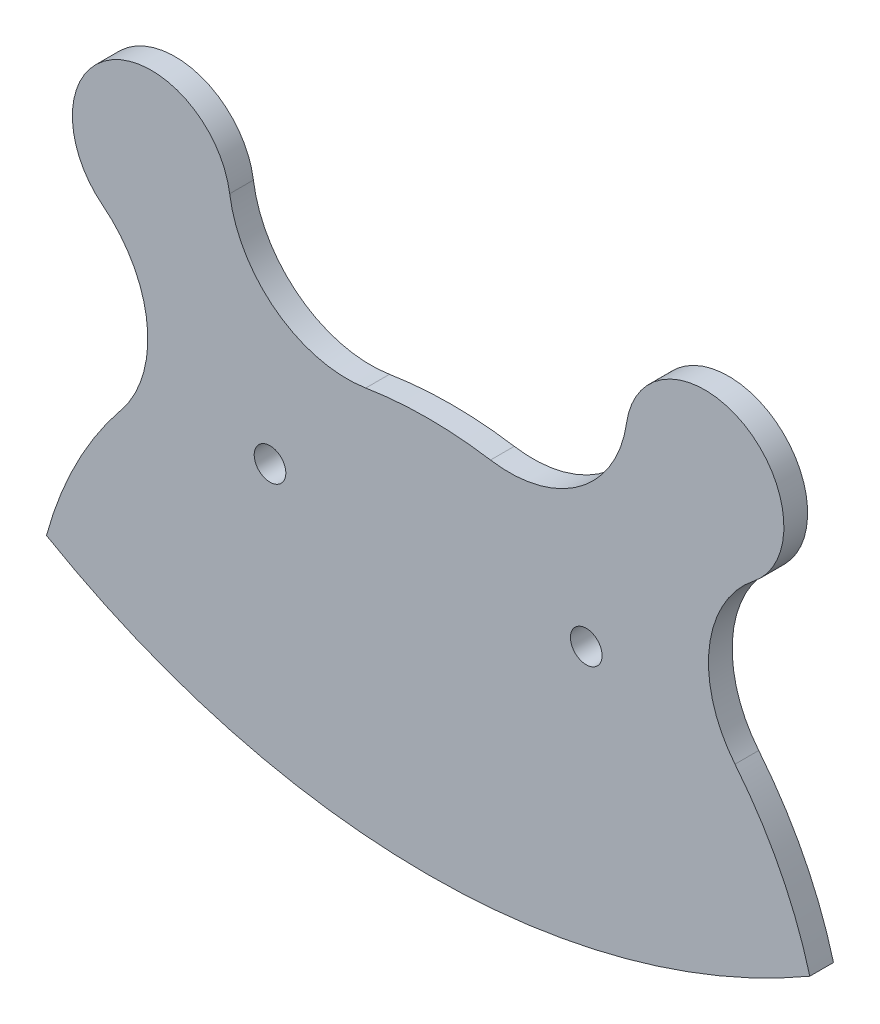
ISO-10303-21;
HEADER;
FILE_DESCRIPTION(('STEP AP214'),'2;1');
FILE_NAME('part.step','',(''),(''),'','','');
FILE_SCHEMA(('AUTOMOTIVE_DESIGN { 1 0 10303 214 1 1 1 1 }'));
ENDSEC;
DATA;
#1=APPLICATION_CONTEXT('core data for automotive mechanical design processes');
#2=APPLICATION_PROTOCOL_DEFINITION('international standard','automotive_design',2000,#1);
#3=PRODUCT_CONTEXT('',#1,'mechanical');
#4=PRODUCT('Part','Part','',(#3));
#5=PRODUCT_RELATED_PRODUCT_CATEGORY('part','',(#4));
#6=PRODUCT_DEFINITION_FORMATION('','',#4);
#7=PRODUCT_DEFINITION_CONTEXT('part definition',#1,'design');
#8=PRODUCT_DEFINITION('design','',#6,#7);
#9=PRODUCT_DEFINITION_SHAPE('','',#8);
#10=(LENGTH_UNIT() NAMED_UNIT(*) SI_UNIT(.MILLI.,.METRE.));
#11=(NAMED_UNIT(*) PLANE_ANGLE_UNIT() SI_UNIT($,.RADIAN.));
#12=(NAMED_UNIT(*) SI_UNIT($,.STERADIAN.) SOLID_ANGLE_UNIT());
#13=UNCERTAINTY_MEASURE_WITH_UNIT(LENGTH_MEASURE(1.E-05),#10,'distance_accuracy_value','');
#14=(GEOMETRIC_REPRESENTATION_CONTEXT(3) GLOBAL_UNCERTAINTY_ASSIGNED_CONTEXT((#13)) GLOBAL_UNIT_ASSIGNED_CONTEXT((#10,
#11,#12)) REPRESENTATION_CONTEXT('',''));
#15=CARTESIAN_POINT('',(0.,0.,0.));
#16=DIRECTION('',(0.,0.,1.));
#17=DIRECTION('',(1.,0.,0.));
#18=AXIS2_PLACEMENT_3D('',#15,#16,#17);
#19=CARTESIAN_POINT('',(-42.7294623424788,50.7980614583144,3.));
#20=DIRECTION('',(0.,0.,1.));
#21=DIRECTION('',(1.,0.,0.));
#22=AXIS2_PLACEMENT_3D('',#19,#20,#21);
#23=PLANE('',#22);
#24=CARTESIAN_POINT('',(-20.,35.,3.));
#25=DIRECTION('',(0.,0.,1.));
#26=DIRECTION('',(1.,0.,0.));
#27=AXIS2_PLACEMENT_3D('',#24,#25,#26);
#28=CIRCLE('',#27,2.);
#29=CARTESIAN_POINT('',(-18.,35.,3.));
#30=VERTEX_POINT('',#29);
#31=EDGE_CURVE('E143',#30,#30,#28,.T.);
#32=ORIENTED_EDGE('',*,*,#31,.F.);
#33=EDGE_LOOP('',(#32));
#34=FACE_BOUND('',#33,.T.);
#35=CARTESIAN_POINT('',(-50.4589246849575,40.9743446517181,3.));
#36=DIRECTION('',(0.,0.,-1.));
#37=DIRECTION('',(1.,0.,0.));
#38=AXIS2_PLACEMENT_3D('',#35,#36,#37);
#39=CIRCLE('',#38,15.);
#40=CARTESIAN_POINT('',(-41.183569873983,52.7628048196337,3.));
#41=VERTEX_POINT('',#40);
#42=CARTESIAN_POINT('',(-38.8145574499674,31.5187266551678,3.));
#43=VERTEX_POINT('',#42);
#44=EDGE_CURVE('E158',#41,#43,#39,.T.);
#45=ORIENTED_EDGE('',*,*,#44,.T.);
#46=CARTESIAN_POINT('',(0.,0.,3.));
#47=DIRECTION('',(0.,0.,1.));
#48=DIRECTION('',(1.,0.,0.));
#49=AXIS2_PLACEMENT_3D('',#46,#47,#48);
#50=CIRCLE('',#49,50.);
#51=CARTESIAN_POINT('',(-48.2748164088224,13.0208333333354,3.));
#52=VERTEX_POINT('',#51);
#53=EDGE_CURVE('E96',#43,#52,#50,.T.);
#54=ORIENTED_EDGE('',*,*,#53,.T.);
#55=CARTESIAN_POINT('',(0.,95.9999999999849,3.));
#56=DIRECTION('',(0.,0.,1.));
#57=DIRECTION('',(1.,0.,0.));
#58=AXIS2_PLACEMENT_3D('',#55,#56,#57);
#59=CIRCLE('',#58,95.9999999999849);
#60=CARTESIAN_POINT('',(48.2748164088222,13.0208333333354,3.));
#61=VERTEX_POINT('',#60);
#62=EDGE_CURVE('E179',#52,#61,#59,.T.);
#63=ORIENTED_EDGE('',*,*,#62,.T.);
#64=CARTESIAN_POINT('',(0.,0.,3.));
#65=DIRECTION('',(0.,0.,1.));
#66=DIRECTION('',(-1.,0.,0.));
#67=AXIS2_PLACEMENT_3D('',#64,#65,#66);
#68=CIRCLE('',#67,49.9999999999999);
#69=CARTESIAN_POINT('',(38.8145574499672,31.5187266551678,3.));
#70=VERTEX_POINT('',#69);
#71=EDGE_CURVE('E198',#61,#70,#68,.T.);
#72=ORIENTED_EDGE('',*,*,#71,.T.);
#73=CARTESIAN_POINT('',(50.4589246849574,40.9743446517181,3.));
#74=DIRECTION('',(0.,0.,-1.));
#75=DIRECTION('',(-1.,0.,0.));
#76=AXIS2_PLACEMENT_3D('',#73,#74,#75);
#77=CIRCLE('',#76,15.);
#78=CARTESIAN_POINT('',(41.1835698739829,52.7628048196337,3.));
#79=VERTEX_POINT('',#78);
#80=EDGE_CURVE('E195',#70,#79,#77,.T.);
#81=ORIENTED_EDGE('',*,*,#80,.T.);
#82=CARTESIAN_POINT('',(34.9999999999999,60.6217782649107,3.));
#83=DIRECTION('',(0.,0.,1.));
#84=DIRECTION('',(-1.,0.,0.));
#85=AXIS2_PLACEMENT_3D('',#82,#83,#84);
#86=CIRCLE('',#85,10.);
#87=CARTESIAN_POINT('',(25.1021444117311,62.0474201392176,3.));
#88=VERTEX_POINT('',#87);
#89=EDGE_CURVE('E197',#79,#88,#86,.T.);
#90=ORIENTED_EDGE('',*,*,#89,.T.);
#91=CARTESIAN_POINT('',(10.255361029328,64.185882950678,3.));
#92=DIRECTION('',(0.,0.,-1.));
#93=DIRECTION('',(-1.,0.,0.));
#94=AXIS2_PLACEMENT_3D('',#91,#92,#93);
#95=CIRCLE('',#94,15.);
#96=CARTESIAN_POINT('',(7.8887392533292,49.3737561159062,3.));
#97=VERTEX_POINT('',#96);
#98=EDGE_CURVE('E121',#88,#97,#95,.T.);
#99=ORIENTED_EDGE('',*,*,#98,.T.);
#100=CARTESIAN_POINT('',(0.,0.,3.));
#101=DIRECTION('',(0.,0.,1.));
#102=DIRECTION('',(1.,0.,0.));
#103=AXIS2_PLACEMENT_3D('',#100,#101,#102);
#104=CIRCLE('',#103,50.);
#105=CARTESIAN_POINT('',(-7.88873925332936,49.3737561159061,3.));
#106=VERTEX_POINT('',#105);
#107=EDGE_CURVE('E115',#97,#106,#104,.T.);
#108=ORIENTED_EDGE('',*,*,#107,.T.);
#109=CARTESIAN_POINT('',(-10.2553610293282,64.185882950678,3.));
#110=DIRECTION('',(0.,0.,-1.));
#111=DIRECTION('',(1.,0.,0.));
#112=AXIS2_PLACEMENT_3D('',#109,#110,#111);
#113=CIRCLE('',#112,15.);
#114=CARTESIAN_POINT('',(-25.1021444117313,62.0474201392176,3.));
#115=VERTEX_POINT('',#114);
#116=EDGE_CURVE('E119',#106,#115,#113,.T.);
#117=ORIENTED_EDGE('',*,*,#116,.T.);
#118=CARTESIAN_POINT('',(-35.,60.6217782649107,3.));
#119=DIRECTION('',(0.,0.,1.));
#120=DIRECTION('',(1.,0.,0.));
#121=AXIS2_PLACEMENT_3D('',#118,#119,#120);
#122=CIRCLE('',#121,10.);
#123=EDGE_CURVE('E47',#115,#41,#122,.T.);
#124=ORIENTED_EDGE('',*,*,#123,.T.);
#125=EDGE_LOOP('',(#45,#54,#63,#72,#81,#90,#99,#108,#117,#124));
#126=FACE_BOUND('',#125,.T.);
#127=CARTESIAN_POINT('',(20.,35.,3.));
#128=DIRECTION('',(0.,0.,1.));
#129=DIRECTION('',(1.,0.,0.));
#130=AXIS2_PLACEMENT_3D('',#127,#128,#129);
#131=CIRCLE('',#130,2.00000000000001);
#132=CARTESIAN_POINT('',(22.,35.,3.));
#133=VERTEX_POINT('',#132);
#134=EDGE_CURVE('E209',#133,#133,#131,.T.);
#135=ORIENTED_EDGE('',*,*,#134,.F.);
#136=EDGE_LOOP('',(#135));
#137=FACE_BOUND('',#136,.T.);
#138=ADVANCED_FACE('F30',(#34,#126,#137),#23,.T.);
#139=CARTESIAN_POINT('',(-42.7294623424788,50.7980614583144,0.));
#140=DIRECTION('',(0.,0.,1.));
#141=DIRECTION('',(1.,0.,0.));
#142=AXIS2_PLACEMENT_3D('',#139,#140,#141);
#143=PLANE('',#142);
#144=CARTESIAN_POINT('',(-20.,35.,0.));
#145=DIRECTION('',(0.,0.,1.));
#146=DIRECTION('',(1.,0.,0.));
#147=AXIS2_PLACEMENT_3D('',#144,#145,#146);
#148=CIRCLE('',#147,2.);
#149=CARTESIAN_POINT('',(-18.,35.,0.));
#150=VERTEX_POINT('',#149);
#151=EDGE_CURVE('E206',#150,#150,#148,.T.);
#152=ORIENTED_EDGE('',*,*,#151,.T.);
#153=EDGE_LOOP('',(#152));
#154=FACE_BOUND('',#153,.T.);
#155=CARTESIAN_POINT('',(-50.4589246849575,40.9743446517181,0.));
#156=DIRECTION('',(0.,0.,-1.));
#157=DIRECTION('',(1.,0.,0.));
#158=AXIS2_PLACEMENT_3D('',#155,#156,#157);
#159=CIRCLE('',#158,15.);
#160=CARTESIAN_POINT('',(-41.183569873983,52.7628048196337,0.));
#161=VERTEX_POINT('',#160);
#162=CARTESIAN_POINT('',(-38.8145574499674,31.5187266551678,0.));
#163=VERTEX_POINT('',#162);
#164=EDGE_CURVE('E139',#161,#163,#159,.T.);
#165=ORIENTED_EDGE('',*,*,#164,.F.);
#166=CARTESIAN_POINT('',(-35.,60.6217782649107,0.));
#167=DIRECTION('',(0.,0.,1.));
#168=DIRECTION('',(1.,0.,0.));
#169=AXIS2_PLACEMENT_3D('',#166,#167,#168);
#170=CIRCLE('',#169,10.);
#171=CARTESIAN_POINT('',(-25.1021444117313,62.0474201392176,0.));
#172=VERTEX_POINT('',#171);
#173=EDGE_CURVE('E88',#172,#161,#170,.T.);
#174=ORIENTED_EDGE('',*,*,#173,.F.);
#175=CARTESIAN_POINT('',(-10.2553610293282,64.185882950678,0.));
#176=DIRECTION('',(0.,0.,-1.));
#177=DIRECTION('',(1.,0.,0.));
#178=AXIS2_PLACEMENT_3D('',#175,#176,#177);
#179=CIRCLE('',#178,15.);
#180=CARTESIAN_POINT('',(-7.88873925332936,49.3737561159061,0.));
#181=VERTEX_POINT('',#180);
#182=EDGE_CURVE('E82',#181,#172,#179,.T.);
#183=ORIENTED_EDGE('',*,*,#182,.F.);
#184=CARTESIAN_POINT('',(0.,0.,0.));
#185=DIRECTION('',(0.,0.,1.));
#186=DIRECTION('',(1.,0.,0.));
#187=AXIS2_PLACEMENT_3D('',#184,#185,#186);
#188=CIRCLE('',#187,50.);
#189=CARTESIAN_POINT('',(7.8887392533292,49.3737561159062,0.));
#190=VERTEX_POINT('',#189);
#191=EDGE_CURVE('E129',#190,#181,#188,.T.);
#192=ORIENTED_EDGE('',*,*,#191,.F.);
#193=CARTESIAN_POINT('',(10.255361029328,64.185882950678,0.));
#194=DIRECTION('',(0.,0.,-1.));
#195=DIRECTION('',(-1.,0.,0.));
#196=AXIS2_PLACEMENT_3D('',#193,#194,#195);
#197=CIRCLE('',#196,15.);
#198=CARTESIAN_POINT('',(25.1021444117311,62.0474201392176,0.));
#199=VERTEX_POINT('',#198);
#200=EDGE_CURVE('E153',#199,#190,#197,.T.);
#201=ORIENTED_EDGE('',*,*,#200,.F.);
#202=CARTESIAN_POINT('',(34.9999999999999,60.6217782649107,0.));
#203=DIRECTION('',(0.,0.,1.));
#204=DIRECTION('',(-1.,0.,0.));
#205=AXIS2_PLACEMENT_3D('',#202,#203,#204);
#206=CIRCLE('',#205,10.);
#207=CARTESIAN_POINT('',(41.1835698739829,52.7628048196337,0.));
#208=VERTEX_POINT('',#207);
#209=EDGE_CURVE('E151',#208,#199,#206,.T.);
#210=ORIENTED_EDGE('',*,*,#209,.F.);
#211=CARTESIAN_POINT('',(50.4589246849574,40.9743446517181,0.));
#212=DIRECTION('',(0.,0.,-1.));
#213=DIRECTION('',(-1.,0.,0.));
#214=AXIS2_PLACEMENT_3D('',#211,#212,#213);
#215=CIRCLE('',#214,15.);
#216=CARTESIAN_POINT('',(38.8145574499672,31.5187266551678,0.));
#217=VERTEX_POINT('',#216);
#218=EDGE_CURVE('E149',#217,#208,#215,.T.);
#219=ORIENTED_EDGE('',*,*,#218,.F.);
#220=CARTESIAN_POINT('',(0.,0.,0.));
#221=DIRECTION('',(0.,0.,1.));
#222=DIRECTION('',(-1.,0.,0.));
#223=AXIS2_PLACEMENT_3D('',#220,#221,#222);
#224=CIRCLE('',#223,49.9999999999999);
#225=CARTESIAN_POINT('',(48.2748164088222,13.0208333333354,0.));
#226=VERTEX_POINT('',#225);
#227=EDGE_CURVE('E147',#226,#217,#224,.T.);
#228=ORIENTED_EDGE('',*,*,#227,.F.);
#229=CARTESIAN_POINT('',(0.,95.9999999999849,0.));
#230=DIRECTION('',(0.,0.,1.));
#231=DIRECTION('',(1.,0.,0.));
#232=AXIS2_PLACEMENT_3D('',#229,#230,#231);
#233=CIRCLE('',#232,95.9999999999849);
#234=CARTESIAN_POINT('',(-48.2748164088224,13.0208333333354,0.));
#235=VERTEX_POINT('',#234);
#236=EDGE_CURVE('E145',#235,#226,#233,.T.);
#237=ORIENTED_EDGE('',*,*,#236,.F.);
#238=CARTESIAN_POINT('',(0.,0.,0.));
#239=DIRECTION('',(0.,0.,1.));
#240=DIRECTION('',(1.,0.,0.));
#241=AXIS2_PLACEMENT_3D('',#238,#239,#240);
#242=CIRCLE('',#241,50.);
#243=EDGE_CURVE('E142',#163,#235,#242,.T.);
#244=ORIENTED_EDGE('',*,*,#243,.F.);
#245=EDGE_LOOP('',(#165,#174,#183,#192,#201,#210,#219,#228,#237,#244));
#246=FACE_BOUND('',#245,.T.);
#247=CARTESIAN_POINT('',(20.,35.,0.));
#248=DIRECTION('',(0.,0.,1.));
#249=DIRECTION('',(1.,0.,0.));
#250=AXIS2_PLACEMENT_3D('',#247,#248,#249);
#251=CIRCLE('',#250,2.00000000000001);
#252=CARTESIAN_POINT('',(22.,35.,0.));
#253=VERTEX_POINT('',#252);
#254=EDGE_CURVE('E212',#253,#253,#251,.T.);
#255=ORIENTED_EDGE('',*,*,#254,.T.);
#256=EDGE_LOOP('',(#255));
#257=FACE_BOUND('',#256,.T.);
#258=ADVANCED_FACE('F183',(#154,#246,#257),#143,.F.);
#259=CARTESIAN_POINT('',(-50.4589246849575,40.9743446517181,3.));
#260=DIRECTION('',(0.,0.,-1.));
#261=DIRECTION('',(-1.,0.,0.));
#262=AXIS2_PLACEMENT_3D('',#259,#260,#261);
#263=CYLINDRICAL_SURFACE('',#262,15.);
#264=ORIENTED_EDGE('',*,*,#164,.T.);
#265=DIRECTION('',(0.,0.,-1.));
#266=VECTOR('',#265,1.);
#267=CARTESIAN_POINT('',(-38.8145574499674,31.5187266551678,3.));
#268=LINE('',#267,#266);
#269=EDGE_CURVE('E11',#43,#163,#268,.T.);
#270=ORIENTED_EDGE('',*,*,#269,.F.);
#271=ORIENTED_EDGE('',*,*,#44,.F.);
#272=DIRECTION('',(0.,0.,-1.));
#273=VECTOR('',#272,1.);
#274=CARTESIAN_POINT('',(-41.183569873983,52.7628048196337,3.));
#275=LINE('',#274,#273);
#276=EDGE_CURVE('E135',#41,#161,#275,.T.);
#277=ORIENTED_EDGE('',*,*,#276,.T.);
#278=EDGE_LOOP('',(#264,#270,#271,#277));
#279=FACE_BOUND('',#278,.T.);
#280=ADVANCED_FACE('F32',(#279),#263,.F.);
#281=CARTESIAN_POINT('',(0.,0.,3.));
#282=DIRECTION('',(0.,0.,-1.));
#283=DIRECTION('',(-1.,0.,0.));
#284=AXIS2_PLACEMENT_3D('',#281,#282,#283);
#285=CYLINDRICAL_SURFACE('',#284,50.);
#286=ORIENTED_EDGE('',*,*,#243,.T.);
#287=DIRECTION('',(0.,0.,-1.));
#288=VECTOR('',#287,1.);
#289=CARTESIAN_POINT('',(-48.2748164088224,13.0208333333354,3.));
#290=LINE('',#289,#288);
#291=EDGE_CURVE('E39',#52,#235,#290,.T.);
#292=ORIENTED_EDGE('',*,*,#291,.F.);
#293=ORIENTED_EDGE('',*,*,#53,.F.);
#294=ORIENTED_EDGE('',*,*,#269,.T.);
#295=EDGE_LOOP('',(#286,#292,#293,#294));
#296=FACE_BOUND('',#295,.T.);
#297=ADVANCED_FACE('F253',(#296),#285,.T.);
#298=CARTESIAN_POINT('',(0.,95.9999999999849,3.));
#299=DIRECTION('',(0.,0.,-1.));
#300=DIRECTION('',(-1.,0.,0.));
#301=AXIS2_PLACEMENT_3D('',#298,#299,#300);
#302=CYLINDRICAL_SURFACE('',#301,95.9999999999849);
#303=ORIENTED_EDGE('',*,*,#236,.T.);
#304=DIRECTION('',(0.,0.,-1.));
#305=VECTOR('',#304,1.);
#306=CARTESIAN_POINT('',(48.2748164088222,13.0208333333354,3.));
#307=LINE('',#306,#305);
#308=EDGE_CURVE('E171',#61,#226,#307,.T.);
#309=ORIENTED_EDGE('',*,*,#308,.F.);
#310=ORIENTED_EDGE('',*,*,#62,.F.);
#311=ORIENTED_EDGE('',*,*,#291,.T.);
#312=EDGE_LOOP('',(#303,#309,#310,#311));
#313=FACE_BOUND('',#312,.T.);
#314=ADVANCED_FACE('F177',(#313),#302,.T.);
#315=CARTESIAN_POINT('',(0.,0.,3.));
#316=DIRECTION('',(0.,0.,-1.));
#317=DIRECTION('',(-1.,0.,0.));
#318=AXIS2_PLACEMENT_3D('',#315,#316,#317);
#319=CYLINDRICAL_SURFACE('',#318,49.9999999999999);
#320=ORIENTED_EDGE('',*,*,#227,.T.);
#321=DIRECTION('',(0.,0.,-1.));
#322=VECTOR('',#321,1.);
#323=CARTESIAN_POINT('',(38.8145574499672,31.5187266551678,3.));
#324=LINE('',#323,#322);
#325=EDGE_CURVE('E168',#70,#217,#324,.T.);
#326=ORIENTED_EDGE('',*,*,#325,.F.);
#327=ORIENTED_EDGE('',*,*,#71,.F.);
#328=ORIENTED_EDGE('',*,*,#308,.T.);
#329=EDGE_LOOP('',(#320,#326,#327,#328));
#330=FACE_BOUND('',#329,.T.);
#331=ADVANCED_FACE('F189',(#330),#319,.T.);
#332=CARTESIAN_POINT('',(50.4589246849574,40.9743446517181,3.));
#333=DIRECTION('',(0.,0.,-1.));
#334=DIRECTION('',(-1.,0.,0.));
#335=AXIS2_PLACEMENT_3D('',#332,#333,#334);
#336=CYLINDRICAL_SURFACE('',#335,15.);
#337=ORIENTED_EDGE('',*,*,#218,.T.);
#338=DIRECTION('',(0.,0.,-1.));
#339=VECTOR('',#338,1.);
#340=CARTESIAN_POINT('',(41.1835698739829,52.7628048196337,3.));
#341=LINE('',#340,#339);
#342=EDGE_CURVE('E165',#79,#208,#341,.T.);
#343=ORIENTED_EDGE('',*,*,#342,.F.);
#344=ORIENTED_EDGE('',*,*,#80,.F.);
#345=ORIENTED_EDGE('',*,*,#325,.T.);
#346=EDGE_LOOP('',(#337,#343,#344,#345));
#347=FACE_BOUND('',#346,.T.);
#348=ADVANCED_FACE('F193',(#347),#336,.F.);
#349=CARTESIAN_POINT('',(34.9999999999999,60.6217782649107,3.));
#350=DIRECTION('',(0.,0.,-1.));
#351=DIRECTION('',(-1.,0.,0.));
#352=AXIS2_PLACEMENT_3D('',#349,#350,#351);
#353=CYLINDRICAL_SURFACE('',#352,10.);
#354=ORIENTED_EDGE('',*,*,#209,.T.);
#355=DIRECTION('',(0.,0.,-1.));
#356=VECTOR('',#355,1.);
#357=CARTESIAN_POINT('',(25.1021444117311,62.0474201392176,3.));
#358=LINE('',#357,#356);
#359=EDGE_CURVE('E162',#88,#199,#358,.T.);
#360=ORIENTED_EDGE('',*,*,#359,.F.);
#361=ORIENTED_EDGE('',*,*,#89,.F.);
#362=ORIENTED_EDGE('',*,*,#342,.T.);
#363=EDGE_LOOP('',(#354,#360,#361,#362));
#364=FACE_BOUND('',#363,.T.);
#365=ADVANCED_FACE('F243',(#364),#353,.T.);
#366=CARTESIAN_POINT('',(10.255361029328,64.185882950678,3.));
#367=DIRECTION('',(0.,0.,-1.));
#368=DIRECTION('',(-1.,0.,0.));
#369=AXIS2_PLACEMENT_3D('',#366,#367,#368);
#370=CYLINDRICAL_SURFACE('',#369,15.);
#371=ORIENTED_EDGE('',*,*,#200,.T.);
#372=DIRECTION('',(0.,0.,-1.));
#373=VECTOR('',#372,1.);
#374=CARTESIAN_POINT('',(7.8887392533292,49.3737561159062,3.));
#375=LINE('',#374,#373);
#376=EDGE_CURVE('E130',#97,#190,#375,.T.);
#377=ORIENTED_EDGE('',*,*,#376,.F.);
#378=ORIENTED_EDGE('',*,*,#98,.F.);
#379=ORIENTED_EDGE('',*,*,#359,.T.);
#380=EDGE_LOOP('',(#371,#377,#378,#379));
#381=FACE_BOUND('',#380,.T.);
#382=ADVANCED_FACE('F240',(#381),#370,.F.);
#383=CARTESIAN_POINT('',(0.,0.,3.));
#384=DIRECTION('',(0.,0.,-1.));
#385=DIRECTION('',(-1.,0.,0.));
#386=AXIS2_PLACEMENT_3D('',#383,#384,#385);
#387=CYLINDRICAL_SURFACE('',#386,50.);
#388=ORIENTED_EDGE('',*,*,#191,.T.);
#389=DIRECTION('',(0.,0.,-1.));
#390=VECTOR('',#389,1.);
#391=CARTESIAN_POINT('',(-7.88873925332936,49.3737561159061,3.));
#392=LINE('',#391,#390);
#393=EDGE_CURVE('E126',#106,#181,#392,.T.);
#394=ORIENTED_EDGE('',*,*,#393,.F.);
#395=ORIENTED_EDGE('',*,*,#107,.F.);
#396=ORIENTED_EDGE('',*,*,#376,.T.);
#397=EDGE_LOOP('',(#388,#394,#395,#396));
#398=FACE_BOUND('',#397,.T.);
#399=ADVANCED_FACE('F127',(#398),#387,.T.);
#400=CARTESIAN_POINT('',(-10.2553610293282,64.185882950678,3.));
#401=DIRECTION('',(0.,0.,-1.));
#402=DIRECTION('',(-1.,0.,0.));
#403=AXIS2_PLACEMENT_3D('',#400,#401,#402);
#404=CYLINDRICAL_SURFACE('',#403,15.);
#405=ORIENTED_EDGE('',*,*,#182,.T.);
#406=DIRECTION('',(0.,0.,-1.));
#407=VECTOR('',#406,1.);
#408=CARTESIAN_POINT('',(-25.1021444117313,62.0474201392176,3.));
#409=LINE('',#408,#407);
#410=EDGE_CURVE('E131',#115,#172,#409,.T.);
#411=ORIENTED_EDGE('',*,*,#410,.F.);
#412=ORIENTED_EDGE('',*,*,#116,.F.);
#413=ORIENTED_EDGE('',*,*,#393,.T.);
#414=EDGE_LOOP('',(#405,#411,#412,#413));
#415=FACE_BOUND('',#414,.T.);
#416=ADVANCED_FACE('F133',(#415),#404,.F.);
#417=CARTESIAN_POINT('',(-35.,60.6217782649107,3.));
#418=DIRECTION('',(0.,0.,-1.));
#419=DIRECTION('',(-1.,0.,0.));
#420=AXIS2_PLACEMENT_3D('',#417,#418,#419);
#421=CYLINDRICAL_SURFACE('',#420,10.);
#422=ORIENTED_EDGE('',*,*,#173,.T.);
#423=ORIENTED_EDGE('',*,*,#276,.F.);
#424=ORIENTED_EDGE('',*,*,#123,.F.);
#425=ORIENTED_EDGE('',*,*,#410,.T.);
#426=EDGE_LOOP('',(#422,#423,#424,#425));
#427=FACE_BOUND('',#426,.T.);
#428=ADVANCED_FACE('F233',(#427),#421,.T.);
#429=CARTESIAN_POINT('',(-20.,35.,3.));
#430=DIRECTION('',(0.,0.,-1.));
#431=DIRECTION('',(-1.,0.,0.));
#432=AXIS2_PLACEMENT_3D('',#429,#430,#431);
#433=CYLINDRICAL_SURFACE('',#432,2.);
#434=ORIENTED_EDGE('',*,*,#31,.T.);
#435=EDGE_LOOP('',(#434));
#436=FACE_BOUND('',#435,.T.);
#437=ORIENTED_EDGE('',*,*,#151,.F.);
#438=EDGE_LOOP('',(#437));
#439=FACE_BOUND('',#438,.T.);
#440=ADVANCED_FACE('F230',(#436,#439),#433,.F.);
#441=CARTESIAN_POINT('',(20.,35.,3.));
#442=DIRECTION('',(0.,0.,-1.));
#443=DIRECTION('',(-1.,0.,0.));
#444=AXIS2_PLACEMENT_3D('',#441,#442,#443);
#445=CYLINDRICAL_SURFACE('',#444,2.00000000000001);
#446=ORIENTED_EDGE('',*,*,#134,.T.);
#447=EDGE_LOOP('',(#446));
#448=FACE_BOUND('',#447,.T.);
#449=ORIENTED_EDGE('',*,*,#254,.F.);
#450=EDGE_LOOP('',(#449));
#451=FACE_BOUND('',#450,.T.);
#452=ADVANCED_FACE('F218',(#448,#451),#445,.F.);
#453=CLOSED_SHELL('',(#138,#258,#280,#297,#314,#331,#348,#365,#382,#399,#416,#428,#440,#452));
#454=MANIFOLD_SOLID_BREP('B2',#453);
#455=ADVANCED_BREP_SHAPE_REPRESENTATION('',(#18,#454),#14);
#456=SHAPE_DEFINITION_REPRESENTATION(#9,#455);
ENDSEC;
END-ISO-10303-21;
